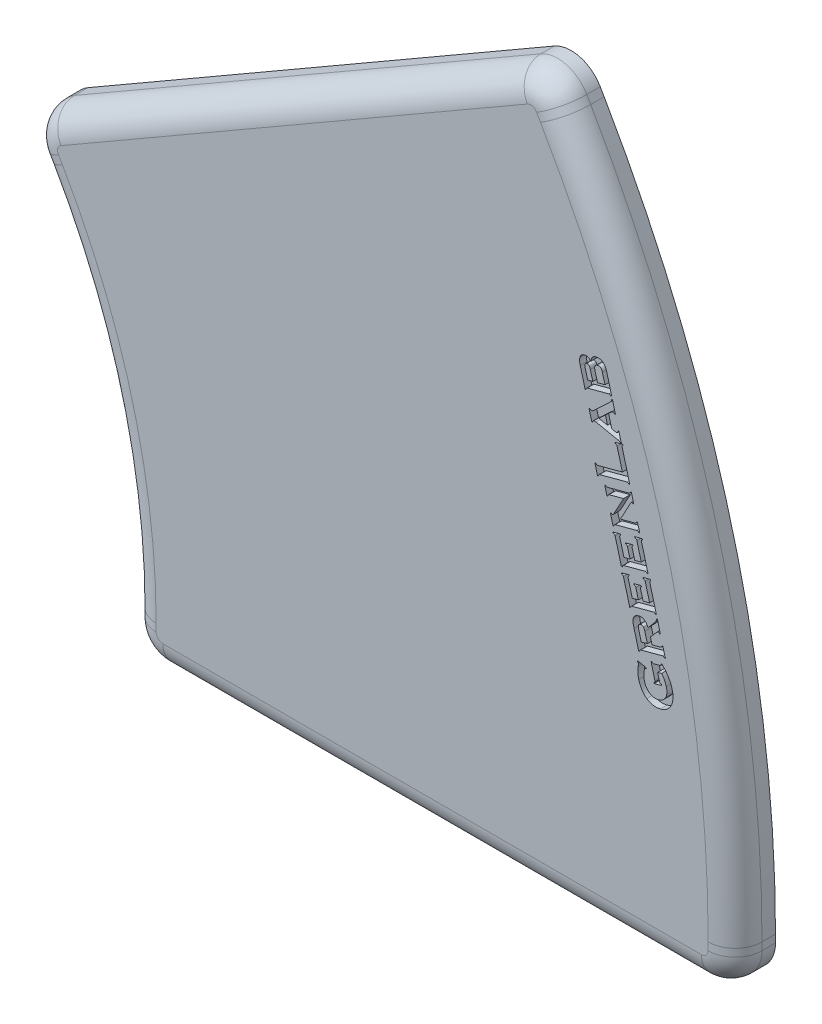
from build123d import *

# Parameters (mm, degrees)
BOSS_EXTRUDE1_DEPTH = 3
FILLET1_R           = 2.500000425
FILLET2_R           = 49.999999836
FILLET3_R           = 94.999999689
FILLET4_R           = 2
CUT_EXTRUDE1_DEPTH  = 0.5


with BuildPart() as part:
    # Sketch1 → Boss-Extrude1 (new body)
    with BuildSketch(Plane.XY.offset(3)):
        Polygon((22.499998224, 6.029140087), (8.235553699, 30.735565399), (-30.735566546, 8.235575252), (-22.500001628, -6.028922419), (-22.500001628, -22.500000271), (22.499998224, -22.500000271), align=None)
    extrude(amount=-BOSS_EXTRUDE1_DEPTH)

    # Fillet1
    fillet1_edges = [part.edges().sort_by_distance(p)[0] for p in [
        (22.499998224, -22.500000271, 1.5),
        (-22.500001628, -22.500000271, 1.5),
        (-30.735566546, 8.235575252, 1.5),
        (8.235553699, 30.735565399, 1.5),
    ]]
    fillet(fillet1_edges, radius=FILLET1_R)

    # Fillet2
    fillet2_edges = [part.edges().sort_by_distance(p)[0] for p in [
        (-22.500001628, -6.028922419, 1.5),
    ]]
    fillet(fillet2_edges, radius=FILLET2_R)

    # Fillet3
    fillet3_edges = [part.edges().sort_by_distance(p)[0] for p in [
        (22.499998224, 6.029140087, 1.5),
    ]]
    fillet(fillet3_edges, radius=FILLET3_R)

    # Fillet4
    fillet4_edges = [part.edges().sort_by_distance(p)[0] for p in [
        (22.499998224, -19.713158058, 3),
        (-11.250003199, 19.485572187, 3),
        (-29.342122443, 5.822045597, 3),
        (-1.702e-06, -22.500000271, 3),
        (7.967543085, 29.735324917, 3),
        (-29.735322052, 7.967559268, 3),
        (21.767765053, -21.767767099, 3),
        (-21.767768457, -21.767767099, 3),
        (-22.500001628, -19.713158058, 3),
        (-24.203694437, -6.485423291, 3),
        (9.628853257, 28.322330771, 3),
        (19.262883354, 5.161748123, 3),
    ]]
    fillet(fillet4_edges, radius=FILLET4_R)

    # Sketch2 → Cut-Extrude1 (cut)
    # profile 1 of 8: a face of its own
    with BuildSketch(Plane.XY.offset(3)):
        with BuildLine():
            add(Edge.make_bspline(
                [(11.784015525, 13.560716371), (11.788785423, 13.586693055), (11.79776732, 13.635608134), (11.817596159, 13.702996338), (11.836841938, 13.761903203), (11.854832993, 13.796002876), (11.863225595, 13.811909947)],
                knots=[0, 0, 0, 0, 1.197007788, 2.254010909, 3.185517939, 4, 4, 4, 4], degree=3))
            add(Edge.make_bspline(
                [(11.863225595, 13.811909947), (11.871223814, 13.825684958), (11.887187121, 13.853177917), (11.916786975, 13.890506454), (11.950199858, 13.924588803), (11.987646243, 13.954777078), (12.028862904, 13.981766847), (12.074079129, 14.004845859), (12.123091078, 14.025380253), (12.157880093, 14.035252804), (12.175725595, 14.040317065)],
                knots=[0, 0, 0, 0, 0.958541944, 1.913113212, 2.860695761, 3.828848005, 4.804875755, 5.823276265, 6.883419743, 8, 8, 8, 8], degree=3))
            add(Edge.make_bspline(
                [(12.175725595, 14.040317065), (12.199864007, 14.046045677), (12.24686738, 14.057200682), (12.317281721, 14.065472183), (12.385356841, 14.0654596), (12.450952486, 14.058048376), (12.514421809, 14.042644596), (12.575343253, 14.01921256), (12.633913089, 13.987649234), (12.669737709, 13.9610253), (12.687878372, 13.947543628)],
                knots=[0, 0, 0, 0, 1.099379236, 2.140759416, 3.135076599, 4.111810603, 5.060899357, 6.022907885, 6.998851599, 8, 8, 8, 8], degree=3))
            add(Edge.make_bspline(
                [(12.687878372, 13.947543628), (12.70374739, 13.934318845), (12.735950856, 13.907481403), (12.779056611, 13.860223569), (12.819545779, 13.80791183), (12.856284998, 13.749627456), (12.889944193, 13.685680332), (12.920867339, 13.616380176), (12.948083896, 13.541083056), (12.962913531, 13.488480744), (12.970538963, 13.461432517)],
                knots=[0, 0, 0, 0, 0.865921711, 1.757240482, 2.677047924, 3.639114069, 4.64392552, 5.707210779, 6.821042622, 8, 8, 8, 8], degree=3))
            Line((12.970538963, 13.461432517), (13.340005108, 12.082309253))
            Line((13.340005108, 12.082309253), (13.270560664, 12.063863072))
            add(Edge.make_bspline(
                [(13.270560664, 12.063863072), (13.265479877, 12.071925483), (13.255880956, 12.087157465), (13.239754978, 12.10719443), (13.222164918, 12.121801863), (13.204298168, 12.132997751), (13.184675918, 12.138896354), (13.163172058, 12.14101245), (13.139519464, 12.13930884), (13.12330692, 12.135364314), (13.114853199, 12.133307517)],
                knots=[0, 0, 0, 0, 1.219507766, 2.303965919, 3.272885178, 4.134119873, 4.983142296, 5.867388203, 6.887990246, 8, 8, 8, 8], degree=3))
            Line((13.114853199, 12.133307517), (11.53065181, 11.709045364))
            add(Edge.make_bspline(
                [(11.53065181, 11.709045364), (11.522268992, 11.706531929), (11.506601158, 11.701834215), (11.485201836, 11.692152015), (11.46833364, 11.679467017), (11.454408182, 11.664880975), (11.444494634, 11.646711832), (11.437791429, 11.624905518), (11.432081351, 11.599354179), (11.43090951, 11.580683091), (11.430282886, 11.57069901)],
                knots=[0, 0, 0, 0, 1.120259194, 2.093810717, 2.9875502, 3.806806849, 4.656892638, 5.608726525, 6.721302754, 8, 8, 8, 8], degree=3))
            Line((11.430282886, 11.57069901), (11.360838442, 11.552252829))
            Line((11.360838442, 11.552252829), (10.998967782, 12.904249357))
            add(Edge.make_bspline(
                [(10.998967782, 12.904249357), (10.991525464, 12.932918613), (10.977101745, 12.988481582), (10.962565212, 13.070348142), (10.951228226, 13.146995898), (10.947961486, 13.219053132), (10.948279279, 13.286221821), (10.955637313, 13.348662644), (10.967362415, 13.406394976), (10.980621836, 13.442033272), (10.987032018, 13.459262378)],
                knots=[0, 0, 0, 0, 1.258748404, 2.43954005, 3.533451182, 4.549791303, 5.50331941, 6.385516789, 7.219488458, 8, 8, 8, 8], degree=3))
            add(Edge.make_bspline(
                [(10.987032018, 13.459262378), (10.994798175, 13.476275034), (11.010094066, 13.509782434), (11.039251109, 13.556212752), (11.072700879, 13.598352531), (11.11188969, 13.634814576), (11.154999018, 13.667025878), (11.202547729, 13.694932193), (11.254833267, 13.717861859), (11.291977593, 13.728765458), (11.310925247, 13.734327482)],
                knots=[0, 0, 0, 0, 1.016246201, 2.001555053, 2.97396476, 3.934209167, 4.904078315, 5.896042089, 6.926752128, 8, 8, 8, 8], degree=3))
            add(Edge.make_bspline(
                [(11.310925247, 13.734327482), (11.333244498, 13.739449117), (11.37607983, 13.74927861), (11.439739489, 13.753899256), (11.499300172, 13.748537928), (11.555935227, 13.733559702), (11.61138194, 13.707161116), (11.66782118, 13.66960163), (11.726610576, 13.620326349), (11.76413553, 13.581359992), (11.784015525, 13.560716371)],
                knots=[0, 0, 0, 0, 1.024066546, 1.965398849, 2.843474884, 3.68985353, 4.573621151, 5.579575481, 6.717705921, 8, 8, 8, 8], degree=3))
        make_face()
        with BuildLine():
            Line((11.932127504, 12.337843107), (11.750378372, 13.016554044))
            add(Edge.make_bspline(
                [(11.750378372, 13.016554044), (11.743107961, 13.041057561), (11.729630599, 13.086480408), (11.706381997, 13.147958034), (11.678264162, 13.195307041), (11.648975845, 13.231817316), (11.613604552, 13.255525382), (11.573241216, 13.268481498), (11.527249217, 13.268700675), (11.496189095, 13.262059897), (11.479653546, 13.25852453)],
                knots=[0, 0, 0, 0, 1.469799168, 2.72460733, 3.764042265, 4.62665216, 5.390733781, 6.176502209, 7.029220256, 8, 8, 8, 8], degree=3))
            add(Edge.make_bspline(
                [(11.479653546, 13.25852453), (11.463829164, 13.253587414), (11.433931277, 13.244259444), (11.395443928, 13.220738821), (11.366791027, 13.190189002), (11.348106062, 13.152366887), (11.339839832, 13.106064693), (11.341684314, 13.050808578), (11.350476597, 12.985329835), (11.362130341, 12.939048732), (11.368433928, 12.914014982)],
                knots=[0, 0, 0, 0, 0.953038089, 1.800628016, 2.567855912, 3.337135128, 4.197894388, 5.250892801, 6.512989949, 8, 8, 8, 8], degree=3))
            Line((11.368433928, 12.914014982), (11.55018306, 12.235304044))
            Line((11.55018306, 12.235304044), (11.932127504, 12.337843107))
        make_face(mode=Mode.SUBTRACT)
        with BuildLine():
            Line((12.834905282, 12.579813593), (12.646645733, 13.281310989))
            add(Edge.make_bspline(
                [(12.646645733, 13.281310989), (12.638869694, 13.307791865), (12.624248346, 13.357584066), (12.59269059, 13.424177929), (12.555247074, 13.478245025), (12.511085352, 13.519105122), (12.460651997, 13.546958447), (12.404045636, 13.5602376), (12.341750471, 13.561511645), (12.299837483, 13.551757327), (12.277722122, 13.546610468)],
                knots=[0, 0, 0, 0, 1.273381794, 2.394349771, 3.388796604, 4.293543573, 5.149618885, 6.018840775, 6.954642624, 8, 8, 8, 8], degree=3))
            add(Edge.make_bspline(
                [(12.277722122, 13.546610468), (12.25623249, 13.539842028), (12.215442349, 13.52699464), (12.161720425, 13.495544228), (12.119991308, 13.455057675), (12.089245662, 13.406121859), (12.072462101, 13.348253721), (12.066955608, 13.282789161), (12.072816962, 13.209410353), (12.084751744, 13.158925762), (12.091090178, 13.13211394)],
                knots=[0, 0, 0, 0, 1.039272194, 1.972674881, 2.84767734, 3.703743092, 4.613444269, 5.604239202, 6.727637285, 8, 8, 8, 8], degree=3))
            Line((12.091090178, 13.13211394), (12.279349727, 12.430616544))
            Line((12.279349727, 12.430616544), (12.834905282, 12.579813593))
        make_face(mode=Mode.SUBTRACT)
    # profile 2 of 8: a face of its own
    with BuildSketch(Plane.XY.offset(3)):
        with BuildLine():
            Line((13.10960784, 10.859195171), (13.338557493, 10.004160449))
            Line((13.338557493, 10.004160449), (13.589208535, 9.943939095))
            add(Edge.make_bspline(
                [(13.589208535, 9.943939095), (13.603103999, 9.941507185), (13.628979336, 9.936978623), (13.665268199, 9.934476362), (13.6963251, 9.934116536), (13.714744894, 9.937871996), (13.723214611, 9.939598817)],
                knots=[0, 0, 0, 0, 1.252881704, 2.333044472, 3.233507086, 4, 4, 4, 4], degree=3))
            add(Edge.make_bspline(
                [(13.723214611, 9.939598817), (13.73006129, 9.941602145), (13.743348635, 9.945490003), (13.76034481, 9.957010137), (13.7749271, 9.970762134), (13.78649517, 9.987935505), (13.794542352, 10.008306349), (13.799283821, 10.0317913), (13.801365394, 10.058202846), (13.800636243, 10.076859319), (13.800254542, 10.086625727)],
                knots=[0, 0, 0, 0, 0.934657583, 1.813889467, 2.673522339, 3.565899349, 4.517420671, 5.541120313, 6.712810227, 8, 8, 8, 8], degree=3))
            Line((13.800254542, 10.086625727), (13.869698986, 10.105071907))
            Line((13.869698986, 10.105071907), (14.060671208, 9.393266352))
            Line((14.060671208, 9.393266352), (13.991226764, 9.374820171))
            add(Edge.make_bspline(
                [(13.991226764, 9.374820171), (13.98659383, 9.38489839), (13.977808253, 9.404010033), (13.961567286, 9.429033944), (13.944097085, 9.449107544), (13.924220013, 9.464853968), (13.900034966, 9.477863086), (13.869109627, 9.488650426), (13.831334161, 9.500126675), (13.80338015, 9.50648533), (13.788318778, 9.509911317)],
                knots=[0, 0, 0, 0, 1.034261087, 1.961301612, 2.774369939, 3.507259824, 4.315583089, 5.325167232, 6.558823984, 8, 8, 8, 8], degree=3))
            Line((13.788318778, 9.509911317), (12.162342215, 9.848995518))
            add(Edge.make_bspline(
                [(12.162342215, 9.848995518), (12.147729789, 9.851660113), (12.119906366, 9.856733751), (12.079583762, 9.859109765), (12.043006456, 9.859058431), (12.020514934, 9.854066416), (12.009889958, 9.851708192)],
                knots=[0, 0, 0, 0, 1.158496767, 2.205886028, 3.15246206, 4, 4, 4, 4], degree=3))
            add(Edge.make_bspline(
                [(12.009889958, 9.851708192), (11.99867573, 9.847483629), (11.976037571, 9.838955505), (11.950723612, 9.809201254), (11.93338093, 9.769711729), (11.928478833, 9.739249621), (11.925797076, 9.722584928)],
                knots=[0, 0, 0, 0, 0.865666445, 1.74752061, 2.767751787, 4, 4, 4, 4], degree=3))
            Line((11.925797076, 9.722584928), (11.856352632, 9.704138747))
            Line((11.856352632, 9.704138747), (11.651274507, 10.46965524))
            Line((11.651274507, 10.46965524), (11.720718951, 10.488101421))
            add(Edge.make_bspline(
                [(11.720718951, 10.488101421), (11.730917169, 10.47529606), (11.749890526, 10.451472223), (11.786314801, 10.427887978), (11.825335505, 10.416127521), (11.850899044, 10.420675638), (11.863948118, 10.422997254)],
                knots=[0, 0, 0, 0, 1.164096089, 2.165752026, 3.063696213, 4, 4, 4, 4], degree=3))
            add(Edge.make_bspline(
                [(11.863948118, 10.422997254), (11.87384621, 10.4263108), (11.895130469, 10.433436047), (11.92629801, 10.451600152), (11.959734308, 10.474942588), (11.981159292, 10.494172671), (11.992528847, 10.504377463)],
                knots=[0, 0, 0, 0, 0.814363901, 1.751158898, 2.806611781, 4, 4, 4, 4], degree=3))
            Line((11.992528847, 10.504377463), (13.182307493, 11.619286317))
            add(Edge.make_bspline(
                [(13.182307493, 11.619286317), (13.197102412, 11.633429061), (13.224107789, 11.659244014), (13.258864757, 11.69633215), (13.28546627, 11.726669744), (13.303376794, 11.753402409), (13.314927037, 11.779382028), (13.320169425, 11.808047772), (13.323148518, 11.840230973), (13.321870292, 11.862879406), (13.321196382, 11.874820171)],
                knots=[0, 0, 0, 0, 1.609807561, 2.938404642, 3.998631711, 4.779990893, 5.46188282, 6.218096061, 7.060539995, 8, 8, 8, 8], degree=3))
            Line((13.321196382, 11.874820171), (13.390640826, 11.893266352))
            Line((13.390640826, 11.893266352), (13.614165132, 11.059933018))
            Line((13.614165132, 11.059933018), (13.544720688, 11.041486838))
            add(Edge.make_bspline(
                [(13.544720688, 11.041486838), (13.540812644, 11.049590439), (13.533409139, 11.064942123), (13.518965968, 11.084621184), (13.503721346, 11.100848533), (13.486841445, 11.113031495), (13.46843673, 11.120780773), (13.448890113, 11.124642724), (13.428049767, 11.124644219), (13.414115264, 11.121683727), (13.406916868, 11.120154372)],
                knots=[0, 0, 0, 0, 1.231489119, 2.332966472, 3.332848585, 4.275727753, 5.164874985, 6.050208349, 6.992761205, 8, 8, 8, 8], degree=3))
            add(Edge.make_bspline(
                [(13.406916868, 11.120154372), (13.397175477, 11.117073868), (13.376274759, 11.110464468), (13.346212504, 11.091982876), (13.313628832, 11.068565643), (13.292769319, 11.049168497), (13.281591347, 11.038774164)],
                knots=[0, 0, 0, 0, 0.809823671, 1.737523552, 2.787608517, 4, 4, 4, 4], degree=3))
            Line((13.281591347, 11.038774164), (13.10960784, 10.859195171))
        make_face()
        Polygon((12.870892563, 10.640553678), (12.381526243, 10.19621774), (13.023887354, 10.067637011), align=None, mode=Mode.SUBTRACT)
    # profile 3 of 8: a face of its own
    with BuildSketch(Plane.XY.offset(3)):
        with BuildLine():
            Line((14.128974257, 7.609811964), (13.735636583, 9.078995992))
            add(Edge.make_bspline(
                [(13.735636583, 9.078995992), (13.733162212, 9.087400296), (13.728469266, 9.103340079), (13.718084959, 9.124807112), (13.705714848, 9.142347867), (13.690920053, 9.156360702), (13.672649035, 9.166051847), (13.651205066, 9.173948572), (13.625435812, 9.17771603), (13.607061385, 9.178792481), (13.597290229, 9.179364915)],
                knots=[0, 0, 0, 0, 1.116980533, 2.118489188, 3.028257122, 3.845116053, 4.692713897, 5.649313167, 6.749951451, 8, 8, 8, 8], degree=3))
            Line((13.597290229, 9.179364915), (13.578301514, 9.24880936))
            Line((13.578301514, 9.24880936), (14.168579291, 9.406686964))
            Line((14.168579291, 9.406686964), (14.187568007, 9.33724252))
            add(Edge.make_bspline(
                [(14.187568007, 9.33724252), (14.17931569, 9.331987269), (14.163698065, 9.322041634), (14.143529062, 9.305539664), (14.128542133, 9.288336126), (14.117414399, 9.270995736), (14.111211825, 9.251773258), (14.110106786, 9.230533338), (14.111600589, 9.206947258), (14.115503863, 9.190715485), (14.117581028, 9.182077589)],
                knots=[0, 0, 0, 0, 1.251164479, 2.367846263, 3.318877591, 4.160015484, 4.986713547, 5.868542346, 6.865724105, 8, 8, 8, 8], degree=3))
            Line((14.117581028, 9.182077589), (14.67856193, 7.087351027))
            Line((14.67856193, 7.087351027), (14.609117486, 7.068904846))
            add(Edge.make_bspline(
                [(14.609117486, 7.068904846), (14.603660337, 7.077151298), (14.593523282, 7.092469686), (14.577036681, 7.112507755), (14.560561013, 7.128061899), (14.542821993, 7.138300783), (14.524037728, 7.144680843), (14.50297319, 7.146545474), (14.479534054, 7.144861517), (14.463493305, 7.140952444), (14.455037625, 7.138891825)],
                knots=[0, 0, 0, 0, 1.273472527, 2.365568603, 3.339083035, 4.174486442, 4.985143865, 5.875617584, 6.880158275, 8, 8, 8, 8], degree=3))
            Line((14.455037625, 7.138891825), (12.450914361, 6.602324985))
            add(Edge.make_bspline(
                [(12.450914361, 6.602324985), (12.442501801, 6.599871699), (12.426702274, 6.595264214), (12.405603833, 6.584788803), (12.388563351, 6.572248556), (12.37484011, 6.557687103), (12.364664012, 6.53989179), (12.357820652, 6.518287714), (12.353715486, 6.49251593), (12.3527115, 6.473940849), (12.352173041, 6.463978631)],
                knots=[0, 0, 0, 0, 1.123146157, 2.109366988, 3.005409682, 3.826777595, 4.65889984, 5.61318665, 6.719900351, 8, 8, 8, 8], degree=3))
            Line((12.352173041, 6.463978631), (12.282728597, 6.44553245))
            Line((12.282728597, 6.44553245), (12.087416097, 7.174699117))
            Line((12.087416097, 7.174699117), (12.156860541, 7.193145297))
            add(Edge.make_bspline(
                [(12.156860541, 7.193145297), (12.161890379, 7.184859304), (12.17145539, 7.169102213), (12.188064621, 7.149339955), (12.204796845, 7.133842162), (12.222521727, 7.122814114), (12.242473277, 7.11768835), (12.26388005, 7.115409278), (12.287709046, 7.117257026), (12.30393383, 7.121108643), (12.312568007, 7.123158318)],
                knots=[0, 0, 0, 0, 1.233803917, 2.346268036, 3.276451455, 4.134146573, 4.97305777, 5.876592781, 6.870008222, 8, 8, 8, 8], degree=3))
            Line((12.312568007, 7.123158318), (14.128974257, 7.609811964))
        make_face()
    # profile 4 of 8: a face of its own
    with BuildSketch(Plane.XY.offset(3)):
        with BuildLine():
            Line((13.979318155, 4.507847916), (15.077408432, 4.80244427))
            add(Edge.make_bspline(
                [(15.077408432, 4.80244427), (15.085804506, 4.804930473), (15.10172868, 4.80964586), (15.123167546, 4.819816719), (15.140476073, 4.832709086), (15.154735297, 4.847689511), (15.165052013, 4.866240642), (15.172588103, 4.888096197), (15.178131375, 4.913402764), (15.178966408, 4.931715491), (15.17940496, 4.941333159)],
                knots=[0, 0, 0, 0, 1.112651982, 2.110279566, 2.997950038, 3.844140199, 4.719814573, 5.672706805, 6.777727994, 8, 8, 8, 8], degree=3))
            Line((15.17940496, 4.941333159), (15.248849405, 4.959779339))
            Line((15.248849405, 4.959779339), (15.415950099, 4.334779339))
            Line((15.415950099, 4.334779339), (15.346505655, 4.316333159))
            add(Edge.make_bspline(
                [(15.346505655, 4.316333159), (15.341424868, 4.32439557), (15.331825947, 4.339627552), (15.315699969, 4.359664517), (15.298109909, 4.374271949), (15.280243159, 4.385467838), (15.260620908, 4.39136644), (15.239117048, 4.393482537), (15.215464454, 4.391778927), (15.199251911, 4.387834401), (15.190798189, 4.385777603)],
                knots=[0, 0, 0, 0, 1.219507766, 2.303965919, 3.272885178, 4.134119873, 4.983142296, 5.867388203, 6.887990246, 8, 8, 8, 8], degree=3))
            Line((15.190798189, 4.385777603), (13.6065968, 3.961515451))
            add(Edge.make_bspline(
                [(13.6065968, 3.961515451), (13.598213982, 3.959002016), (13.582546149, 3.954304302), (13.561146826, 3.944622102), (13.544278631, 3.931937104), (13.530353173, 3.917351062), (13.520439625, 3.899181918), (13.513736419, 3.877375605), (13.508026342, 3.851824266), (13.506854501, 3.833153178), (13.506227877, 3.823169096)],
                knots=[0, 0, 0, 0, 1.120259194, 2.093810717, 2.9875502, 3.806806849, 4.656892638, 5.608726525, 6.721302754, 8, 8, 8, 8], degree=3))
            Line((13.506227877, 3.823169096), (13.436783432, 3.804722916))
            Line((13.436783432, 3.804722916), (13.238215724, 4.545825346))
            Line((13.238215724, 4.545825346), (13.307660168, 4.564271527))
            add(Edge.make_bspline(
                [(13.307660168, 4.564271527), (13.314127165, 4.553852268), (13.325731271, 4.53515639), (13.347038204, 4.513356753), (13.371616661, 4.502394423), (13.38771018, 4.504602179), (13.395550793, 4.505677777)],
                knots=[0, 0, 0, 0, 1.290345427, 2.315341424, 3.179249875, 4, 4, 4, 4], degree=3))
            add(Edge.make_bspline(
                [(13.395550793, 4.505677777), (13.402608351, 4.508416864), (13.418112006, 4.514433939), (13.438989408, 4.532138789), (13.459257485, 4.556897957), (13.471385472, 4.576397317), (13.478016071, 4.587057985)],
                knots=[0, 0, 0, 0, 0.762868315, 1.675827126, 2.729330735, 4, 4, 4, 4], degree=3))
            Line((13.478016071, 4.587057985), (14.218033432, 5.948820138))
            Line((14.218033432, 5.948820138), (13.150867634, 5.662904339))
            add(Edge.make_bspline(
                [(13.150867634, 5.662904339), (13.142503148, 5.660355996), (13.126712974, 5.655545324), (13.104943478, 5.646202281), (13.088034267, 5.633124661), (13.073491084, 5.618949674), (13.063684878, 5.600534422), (13.056792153, 5.578838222), (13.051844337, 5.553156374), (13.050967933, 5.534530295), (13.05049871, 5.524557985)],
                knots=[0, 0, 0, 0, 1.116021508, 2.106785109, 2.997143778, 3.829119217, 4.675989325, 5.62422264, 6.72802063, 8, 8, 8, 8], degree=3))
            Line((13.05049871, 5.524557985), (12.981054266, 5.506111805))
            Line((12.981054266, 5.506111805), (12.813411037, 6.131111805))
            Line((12.813411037, 6.131111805), (12.882855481, 6.149557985))
            add(Edge.make_bspline(
                [(12.882855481, 6.149557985), (12.888267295, 6.141271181), (12.898384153, 6.125779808), (12.915509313, 6.106151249), (12.932001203, 6.090181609), (12.950281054, 6.080231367), (12.969541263, 6.073571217), (12.991005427, 6.072857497), (13.014625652, 6.073322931), (13.030652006, 6.077413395), (13.039105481, 6.079571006)],
                knots=[0, 0, 0, 0, 1.261303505, 2.357883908, 3.322095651, 4.169556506, 4.994397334, 5.897257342, 6.890859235, 8, 8, 8, 8], degree=3))
            Line((13.039105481, 6.079571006), (14.621679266, 6.503833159))
            add(Edge.make_bspline(
                [(14.621679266, 6.503833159), (14.630086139, 6.506304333), (14.646030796, 6.510991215), (14.667237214, 6.52130531), (14.684704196, 6.533350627), (14.6984658, 6.548026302), (14.708387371, 6.566396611), (14.715701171, 6.588250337), (14.721295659, 6.614079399), (14.722492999, 6.632742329), (14.723133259, 6.642722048)],
                knots=[0, 0, 0, 0, 1.113758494, 2.1123782, 2.987410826, 3.801913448, 4.647066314, 5.622602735, 6.728722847, 8, 8, 8, 8], degree=3))
            Line((14.723133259, 6.642722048), (14.792577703, 6.661168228))
            Line((14.792577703, 6.661168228), (14.978124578, 5.969978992))
            Line((14.978124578, 5.969978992), (14.908680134, 5.951532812))
            add(Edge.make_bspline(
                [(14.908680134, 5.951532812), (14.903035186, 5.962010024), (14.89282025, 5.980969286), (14.872097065, 6.002181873), (14.848241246, 6.01352578), (14.83244659, 6.011255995), (14.824587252, 6.010126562)],
                knots=[0, 0, 0, 0, 1.277934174, 2.312512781, 3.160315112, 4, 4, 4, 4], degree=3))
            add(Edge.make_bspline(
                [(14.824587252, 6.010126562), (14.816628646, 6.006854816), (14.799079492, 5.99964044), (14.782067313, 5.978970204), (14.766195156, 5.956192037), (14.750425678, 5.929053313), (14.728326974, 5.894936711), (14.713066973, 5.868781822), (14.704687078, 5.854419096)],
                knots=[0, 0, 0, 0, 0.764326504, 1.685380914, 2.340113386, 3.275298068, 4.503754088, 6, 6, 6, 6], degree=3))
            Line((14.704687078, 5.854419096), (13.979318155, 4.507847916))
        make_face()
    # profile 5 of 8: a face of its own
    with BuildSketch(Plane.XY.offset(3)):
        with BuildLine():
            Line((15.044826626, 2.387335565), (15.530937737, 2.518086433))
            Line((15.530937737, 2.518086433), (15.202161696, 3.74475744))
            add(Edge.make_bspline(
                [(15.202161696, 3.74475744), (15.199597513, 3.752938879), (15.194711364, 3.768528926), (15.185430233, 3.790101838), (15.172576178, 3.807077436), (15.158088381, 3.820864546), (15.14002774, 3.831011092), (15.118396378, 3.838482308), (15.092338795, 3.84246011), (15.073772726, 3.843489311), (15.063815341, 3.844041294)],
                knots=[0, 0, 0, 0, 1.098587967, 2.093401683, 2.987400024, 3.806893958, 4.637117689, 5.618632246, 6.722820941, 8, 8, 8, 8], degree=3))
            Line((15.063815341, 3.844041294), (15.045369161, 3.913485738))
            Line((15.045369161, 3.913485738), (15.600924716, 4.062140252))
            Line((15.600924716, 4.062140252), (15.619370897, 3.992695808))
            add(Edge.make_bspline(
                [(15.619370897, 3.992695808), (15.611308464, 3.987615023), (15.596076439, 3.978016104), (15.576039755, 3.961890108), (15.561431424, 3.944300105), (15.550238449, 3.926433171), (15.544276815, 3.906637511), (15.542242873, 3.884942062), (15.543915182, 3.861112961), (15.547866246, 3.844899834), (15.549926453, 3.836445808)],
                knots=[0, 0, 0, 0, 1.216009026, 2.297355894, 3.263495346, 4.122259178, 4.968845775, 5.873506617, 6.891180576, 8, 8, 8, 8], degree=3))
            Line((15.549926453, 3.836445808), (16.036037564, 2.020582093))
            Line((16.036037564, 2.020582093), (15.966593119, 2.002135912))
            add(Edge.make_bspline(
                [(15.966593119, 2.002135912), (15.961512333, 2.010198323), (15.951913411, 2.025430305), (15.935787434, 2.04546727), (15.918197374, 2.060074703), (15.900330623, 2.071270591), (15.880708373, 2.077169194), (15.859204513, 2.07928529), (15.835551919, 2.07758168), (15.819339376, 2.073637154), (15.810885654, 2.071580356)],
                knots=[0, 0, 0, 0, 1.219507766, 2.303965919, 3.272885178, 4.134119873, 4.983142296, 5.867388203, 6.887990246, 8, 8, 8, 8], degree=3))
            Line((15.810885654, 2.071580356), (14.226684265, 1.647318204))
            add(Edge.make_bspline(
                [(14.226684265, 1.647318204), (14.218301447, 1.644804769), (14.202633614, 1.640107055), (14.181234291, 1.630424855), (14.164366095, 1.617739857), (14.150440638, 1.603153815), (14.14052709, 1.584984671), (14.133823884, 1.563178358), (14.128113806, 1.537627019), (14.126941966, 1.518955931), (14.126315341, 1.50897185)],
                knots=[0, 0, 0, 0, 1.120259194, 2.093810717, 2.9875502, 3.806806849, 4.656892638, 5.608726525, 6.721302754, 8, 8, 8, 8], degree=3))
            Line((14.126315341, 1.50897185), (14.056870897, 1.490525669))
            Line((14.056870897, 1.490525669), (13.589205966, 3.236402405))
            add(Edge.make_bspline(
                [(13.589205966, 3.236402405), (13.586753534, 3.244994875), (13.582144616, 3.26114292), (13.57164735, 3.282753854), (13.559285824, 3.300297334), (13.544489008, 3.314309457), (13.526218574, 3.324001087), (13.504774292, 3.331896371), (13.478826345, 3.335696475), (13.46026951, 3.336749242), (13.450317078, 3.337313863)],
                knots=[0, 0, 0, 0, 1.132581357, 2.128488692, 3.0331684, 3.845458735, 4.688316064, 5.639565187, 6.734047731, 8, 8, 8, 8], degree=3))
            Line((13.450317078, 3.337313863), (13.431870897, 3.406758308))
            Line((13.431870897, 3.406758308), (13.987426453, 3.555955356))
            Line((13.987426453, 3.555955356), (14.005872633, 3.486510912))
            add(Edge.make_bspline(
                [(14.005872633, 3.486510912), (13.997693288, 3.480987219), (13.982383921, 3.470648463), (13.961419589, 3.454855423), (13.947104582, 3.437056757), (13.935487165, 3.419854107), (13.930427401, 3.40034698), (13.928124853, 3.379317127), (13.929992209, 3.355660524), (13.933838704, 3.339436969), (13.935885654, 3.330803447)],
                knots=[0, 0, 0, 0, 1.262388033, 2.362825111, 3.330075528, 4.170045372, 4.988779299, 5.871502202, 6.867299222, 8, 8, 8, 8], degree=3))
            Line((13.935885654, 3.330803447), (14.246215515, 2.173576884))
            Line((14.246215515, 2.173576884), (14.697604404, 2.294562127))
            Line((14.697604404, 2.294562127), (14.507717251, 3.002027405))
            add(Edge.make_bspline(
                [(14.507717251, 3.002027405), (14.505516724, 3.010295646), (14.501374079, 3.025861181), (14.490424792, 3.046118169), (14.478960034, 3.063469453), (14.463846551, 3.076574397), (14.445963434, 3.086564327), (14.424171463, 3.093392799), (14.398494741, 3.098223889), (14.379884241, 3.099527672), (14.369913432, 3.10022619)],
                knots=[0, 0, 0, 0, 1.101262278, 2.073202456, 2.961483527, 3.772650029, 4.630598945, 5.591237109, 6.709475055, 8, 8, 8, 8], degree=3))
            Line((14.369913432, 3.10022619), (14.351467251, 3.169670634))
            Line((14.351467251, 3.169670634), (14.907022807, 3.318325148))
            Line((14.907022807, 3.318325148), (14.925468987, 3.248880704))
            add(Edge.make_bspline(
                [(14.925468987, 3.248880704), (14.917406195, 3.243606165), (14.902248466, 3.233690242), (14.882353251, 3.217370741), (14.866978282, 3.200689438), (14.855841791, 3.183163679), (14.849783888, 3.163923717), (14.847961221, 3.142771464), (14.848771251, 3.119270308), (14.852809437, 3.103250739), (14.854939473, 3.094800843)],
                knots=[0, 0, 0, 0, 1.241022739, 2.33307342, 3.306547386, 4.153857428, 4.986621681, 5.877058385, 6.880204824, 8, 8, 8, 8], degree=3))
            Line((14.854939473, 3.094800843), (15.044826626, 2.387335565))
        make_face()
    # profile 6 of 8: a face of its own
    with BuildSketch(Plane.XY.offset(3)):
        with BuildLine():
            Line((15.664914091, 0.073138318), (16.151025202, 0.203889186))
            Line((16.151025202, 0.203889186), (15.82224916, 1.430560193))
            add(Edge.make_bspline(
                [(15.82224916, 1.430560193), (15.819684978, 1.438741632), (15.814798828, 1.45433168), (15.805517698, 1.475904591), (15.792663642, 1.492880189), (15.778175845, 1.506667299), (15.760115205, 1.516813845), (15.738483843, 1.524285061), (15.71242626, 1.528262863), (15.693860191, 1.529292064), (15.683902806, 1.529844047)],
                knots=[0, 0, 0, 0, 1.098587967, 2.093401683, 2.987400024, 3.806893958, 4.637117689, 5.618632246, 6.722820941, 8, 8, 8, 8], degree=3))
            Line((15.683902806, 1.529844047), (15.665456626, 1.599288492))
            Line((15.665456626, 1.599288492), (16.221012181, 1.747943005))
            Line((16.221012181, 1.747943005), (16.239458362, 1.678498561))
            add(Edge.make_bspline(
                [(16.239458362, 1.678498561), (16.231395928, 1.673417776), (16.216163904, 1.663818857), (16.196127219, 1.647692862), (16.181518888, 1.630102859), (16.170325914, 1.612235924), (16.16436428, 1.592440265), (16.162330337, 1.570744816), (16.164002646, 1.546915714), (16.16795371, 1.530702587), (16.170013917, 1.522248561)],
                knots=[0, 0, 0, 0, 1.216009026, 2.297355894, 3.263495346, 4.122259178, 4.968845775, 5.873506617, 6.891180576, 8, 8, 8, 8], degree=3))
            Line((16.170013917, 1.522248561), (16.656125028, -0.293615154))
            Line((16.656125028, -0.293615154), (16.586680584, -0.312061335))
            add(Edge.make_bspline(
                [(16.586680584, -0.312061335), (16.581599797, -0.303998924), (16.572000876, -0.288766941), (16.555874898, -0.268729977), (16.538284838, -0.254122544), (16.520418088, -0.242926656), (16.500795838, -0.237028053), (16.479291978, -0.234911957), (16.455639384, -0.236615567), (16.43942684, -0.240560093), (16.430973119, -0.24261689)],
                knots=[0, 0, 0, 0, 1.219507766, 2.303965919, 3.272885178, 4.134119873, 4.983142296, 5.867388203, 6.887990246, 8, 8, 8, 8], degree=3))
            Line((16.430973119, -0.24261689), (14.84677173, -0.666879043))
            add(Edge.make_bspline(
                [(14.84677173, -0.666879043), (14.838388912, -0.669392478), (14.822721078, -0.674090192), (14.801321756, -0.683772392), (14.78445356, -0.69645739), (14.770528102, -0.711043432), (14.760614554, -0.729212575), (14.753911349, -0.751018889), (14.748201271, -0.776570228), (14.74702943, -0.795241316), (14.746402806, -0.805225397)],
                knots=[0, 0, 0, 0, 1.120259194, 2.093810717, 2.9875502, 3.806806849, 4.656892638, 5.608726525, 6.721302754, 8, 8, 8, 8], degree=3))
            Line((14.746402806, -0.805225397), (14.676958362, -0.823671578))
            Line((14.676958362, -0.823671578), (14.209293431, 0.922205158))
            add(Edge.make_bspline(
                [(14.209293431, 0.922205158), (14.206840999, 0.930797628), (14.202232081, 0.946945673), (14.191734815, 0.968556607), (14.179373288, 0.986100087), (14.164576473, 1.00011221), (14.146306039, 1.00980384), (14.124861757, 1.017699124), (14.098913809, 1.021499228), (14.080356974, 1.022551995), (14.070404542, 1.023116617)],
                knots=[0, 0, 0, 0, 1.132581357, 2.128488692, 3.0331684, 3.845458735, 4.688316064, 5.639565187, 6.734047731, 8, 8, 8, 8], degree=3))
            Line((14.070404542, 1.023116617), (14.051958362, 1.092561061))
            Line((14.051958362, 1.092561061), (14.607513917, 1.24175811))
            Line((14.607513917, 1.24175811), (14.625960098, 1.172313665))
            add(Edge.make_bspline(
                [(14.625960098, 1.172313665), (14.617780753, 1.166789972), (14.602471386, 1.156451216), (14.581507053, 1.140658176), (14.567192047, 1.12285951), (14.555574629, 1.10565686), (14.550514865, 1.086149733), (14.548212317, 1.065119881), (14.550079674, 1.041463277), (14.553926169, 1.025239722), (14.555973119, 1.0166062)],
                knots=[0, 0, 0, 0, 1.262388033, 2.362825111, 3.330075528, 4.170045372, 4.988779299, 5.871502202, 6.867299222, 8, 8, 8, 8], degree=3))
            Line((14.555973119, 1.0166062), (14.86630298, -0.140620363))
            Line((14.86630298, -0.140620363), (15.317691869, -0.01963512))
            Line((15.317691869, -0.01963512), (15.127804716, 0.687830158))
            add(Edge.make_bspline(
                [(15.127804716, 0.687830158), (15.125604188, 0.696098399), (15.121461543, 0.711663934), (15.110512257, 0.731920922), (15.099047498, 0.749272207), (15.083934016, 0.76237715), (15.066050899, 0.77236708), (15.044258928, 0.779195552), (15.018582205, 0.784026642), (14.999971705, 0.785330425), (14.990000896, 0.786028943)],
                knots=[0, 0, 0, 0, 1.101262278, 2.073202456, 2.961483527, 3.772650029, 4.630598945, 5.591237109, 6.709475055, 8, 8, 8, 8], degree=3))
            Line((14.990000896, 0.786028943), (14.971554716, 0.855473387))
            Line((14.971554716, 0.855473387), (15.527110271, 1.004127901))
            Line((15.527110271, 1.004127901), (15.545556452, 0.934683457))
            add(Edge.make_bspline(
                [(15.545556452, 0.934683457), (15.53749366, 0.929408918), (15.522335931, 0.919492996), (15.502440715, 0.903173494), (15.487065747, 0.886492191), (15.475929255, 0.868966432), (15.469871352, 0.84972647), (15.468048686, 0.828574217), (15.468858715, 0.805073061), (15.472896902, 0.789053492), (15.475026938, 0.780603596)],
                knots=[0, 0, 0, 0, 1.241022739, 2.33307342, 3.306547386, 4.153857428, 4.986621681, 5.877058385, 6.880204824, 8, 8, 8, 8], degree=3))
            Line((15.475026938, 0.780603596), (15.664914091, 0.073138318))
        make_face()
    # profile 7 of 8: a face of its own
    with BuildSketch(Plane.XY.offset(3)):
        with BuildLine():
            Line((16.32993543, -2.408754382), (16.961445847, -2.239483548))
            add(Edge.make_bspline(
                [(16.961445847, -2.239483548), (16.970036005, -2.237028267), (16.986179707, -2.232413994), (17.007819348, -2.221952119), (17.025370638, -2.209402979), (17.039827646, -2.194813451), (17.05041592, -2.176525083), (17.057705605, -2.154343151), (17.06305908, -2.128294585), (17.064727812, -2.109482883), (17.065612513, -2.09950959)],
                knots=[0, 0, 0, 0, 1.120795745, 2.106339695, 3.001605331, 3.821022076, 4.666478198, 5.629241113, 6.74310832, 8, 8, 8, 8], degree=3))
            Line((17.065612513, -2.09950959), (17.135056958, -2.081063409))
            Line((17.135056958, -2.081063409), (17.321146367, -2.775507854))
            Line((17.321146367, -2.775507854), (17.251701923, -2.793954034))
            add(Edge.make_bspline(
                [(17.251701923, -2.793954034), (17.246621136, -2.785891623), (17.237022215, -2.770659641), (17.220896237, -2.750622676), (17.203306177, -2.736015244), (17.185439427, -2.724819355), (17.165817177, -2.718920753), (17.144313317, -2.716804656), (17.120660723, -2.718508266), (17.104448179, -2.722452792), (17.095994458, -2.72450959)],
                knots=[0, 0, 0, 0, 1.219507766, 2.303965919, 3.272885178, 4.134119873, 4.983142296, 5.867388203, 6.887990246, 8, 8, 8, 8], degree=3))
            Line((17.095994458, -2.72450959), (15.511793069, -3.148771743))
            add(Edge.make_bspline(
                [(15.511793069, -3.148771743), (15.503410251, -3.151285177), (15.487742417, -3.155982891), (15.466343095, -3.165665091), (15.449474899, -3.178350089), (15.435549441, -3.192936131), (15.425635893, -3.211105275), (15.418932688, -3.232911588), (15.41322261, -3.258462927), (15.412050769, -3.277134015), (15.411424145, -3.287118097)],
                knots=[0, 0, 0, 0, 1.120259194, 2.093810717, 2.9875502, 3.806806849, 4.656892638, 5.608726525, 6.721302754, 8, 8, 8, 8], degree=3))
            Line((15.411424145, -3.287118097), (15.341979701, -3.305564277))
            Line((15.341979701, -3.305564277), (14.996927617, -2.017586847))
            add(Edge.make_bspline(
                [(14.996927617, -2.017586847), (14.99163035, -1.997345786), (14.981335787, -1.958009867), (14.967213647, -1.900497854), (14.954830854, -1.84639939), (14.943756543, -1.796017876), (14.935114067, -1.749118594), (14.928109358, -1.705882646), (14.922365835, -1.666132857), (14.918233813, -1.618009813), (14.916074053, -1.561095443), (14.920027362, -1.494835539), (14.929294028, -1.430742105), (14.94078982, -1.389595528), (14.946471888, -1.369257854)],
                knots=[0, 0, 0, 0, 1.142332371, 2.219977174, 3.23313443, 4.172389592, 5.036105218, 5.836368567, 6.563885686, 7.228076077, 8.472798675, 9.669523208, 10.848106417, 12, 12, 12, 12], degree=3))
            add(Edge.make_bspline(
                [(14.946471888, -1.369257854), (14.953726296, -1.349144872), (14.967990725, -1.309596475), (14.998231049, -1.25453408), (15.036440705, -1.205149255), (15.081367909, -1.160607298), (15.133858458, -1.121834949), (15.192917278, -1.087940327), (15.259533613, -1.059783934), (15.30710168, -1.045625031), (15.331671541, -1.038311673)],
                knots=[0, 0, 0, 0, 0.964377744, 1.896267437, 2.822271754, 3.774963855, 4.743377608, 5.760219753, 6.843108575, 8, 8, 8, 8], degree=3))
            add(Edge.make_bspline(
                [(15.331671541, -1.038311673), (15.350778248, -1.033668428), (15.387835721, -1.02466285), (15.44319374, -1.0164741), (15.496378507, -1.013099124), (15.547625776, -1.014628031), (15.596715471, -1.021130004), (15.643941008, -1.032465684), (15.68874708, -1.049422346), (15.731943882, -1.070887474), (15.773295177, -1.097790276), (15.813775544, -1.129983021), (15.852660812, -1.168437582), (15.891428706, -1.211849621), (15.928623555, -1.261428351), (15.96496384, -1.316355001), (16.00037556, -1.376899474), (16.022348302, -1.419781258), (16.033711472, -1.441957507)],
                knots=[0, 0, 0, 0, 1.052361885, 2.041056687, 2.991753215, 3.902404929, 4.781573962, 5.638766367, 6.496669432, 7.341078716, 8.216667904, 9.133067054, 10.105410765, 11.141114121, 12.246911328, 13.420495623, 14.666013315, 16, 16, 16, 16], degree=3))
            Line((16.033711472, -1.441957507), (16.472079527, -0.935230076))
            add(Edge.make_bspline(
                [(16.472079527, -0.935230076), (16.490355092, -0.913682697), (16.523981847, -0.874035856), (16.56771647, -0.817154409), (16.601894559, -0.768936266), (16.625833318, -0.726467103), (16.642760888, -0.687863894), (16.652975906, -0.649659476), (16.658246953, -0.610748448), (16.65711103, -0.584763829), (16.656541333, -0.571731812)],
                knots=[0, 0, 0, 0, 1.617246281, 2.975707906, 4.107212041, 4.997179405, 5.762558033, 6.513515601, 7.254486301, 8, 8, 8, 8], degree=3))
            Line((16.656541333, -0.571731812), (16.725985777, -0.553285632))
            Line((16.725985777, -0.553285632), (16.950595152, -1.392586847))
            Line((16.950595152, -1.392586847), (16.881150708, -1.411033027))
            add(Edge.make_bspline(
                [(16.881150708, -1.411033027), (16.873347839, -1.398497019), (16.859363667, -1.37603019), (16.833417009, -1.350809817), (16.805315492, -1.336102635), (16.786504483, -1.338714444), (16.777526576, -1.339960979)],
                knots=[0, 0, 0, 0, 1.308683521, 2.345401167, 3.210311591, 4, 4, 4, 4], degree=3))
            add(Edge.make_bspline(
                [(16.777526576, -1.339960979), (16.770304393, -1.342920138), (16.753834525, -1.349668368), (16.730019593, -1.369242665), (16.702509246, -1.395561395), (16.684355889, -1.417150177), (16.674444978, -1.428936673)],
                knots=[0, 0, 0, 0, 0.67718046, 1.544279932, 2.659288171, 4, 4, 4, 4], degree=3))
            Line((16.674444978, -1.428936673), (16.208407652, -1.954652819))
            Line((16.208407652, -1.954652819), (16.32993543, -2.408754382))
        make_face()
        with BuildLine():
            Line((15.982713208, -2.501527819), (15.794996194, -1.802200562))
            add(Edge.make_bspline(
                [(15.794996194, -1.802200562), (15.787897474, -1.777505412), (15.774709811, -1.731627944), (15.751723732, -1.669005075), (15.726240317, -1.61793227), (15.705643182, -1.58984913), (15.696254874, -1.577048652)],
                knots=[0, 0, 0, 0, 1.245466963, 2.3137689, 3.231404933, 4, 4, 4, 4], degree=3))
            add(Edge.make_bspline(
                [(15.696254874, -1.577048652), (15.689807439, -1.569565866), (15.677205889, -1.554940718), (15.654368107, -1.53747898), (15.629954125, -1.523754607), (15.603193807, -1.514205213), (15.574364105, -1.509703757), (15.543738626, -1.508496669), (15.511080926, -1.511934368), (15.48913316, -1.517277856), (15.477613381, -1.520082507)],
                knots=[0, 0, 0, 0, 0.982860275, 1.92100603, 2.849565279, 3.76808385, 4.737779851, 5.748547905, 6.818274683, 8, 8, 8, 8], degree=3))
            add(Edge.make_bspline(
                [(15.477613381, -1.520082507), (15.458320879, -1.526200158), (15.422287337, -1.537626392), (15.375619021, -1.565072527), (15.340943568, -1.600000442), (15.322839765, -1.635671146), (15.315439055, -1.667237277), (15.31147756, -1.694277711), (15.310622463, -1.724639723), (15.312480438, -1.758146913), (15.316281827, -1.794932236), (15.322812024, -1.834780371), (15.332331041, -1.877936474), (15.339736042, -1.907651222), (15.343607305, -1.923185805)],
                knots=[0, 0, 0, 0, 1.480705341, 2.765585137, 3.928414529, 5.043304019, 5.644713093, 6.301063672, 7.044113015, 7.86721251, 8.760487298, 9.754566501, 10.826109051, 12, 12, 12, 12], degree=3))
            Line((15.343607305, -1.923185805), (15.531324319, -2.622513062))
            Line((15.531324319, -2.622513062), (15.982713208, -2.501527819))
        make_face(mode=Mode.SUBTRACT)
    # profile 8 of 8: a face of its own
    with BuildSketch(Plane.XY.offset(3)):
        with BuildLine():
            Line((16.746868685, -3.965389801), (16.892810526, -4.509009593))
            add(Edge.make_bspline(
                [(16.892810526, -4.509009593), (16.895122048, -4.516686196), (16.89953506, -4.531341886), (16.909181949, -4.550812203), (16.920727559, -4.566685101), (16.934954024, -4.578813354), (16.952817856, -4.586929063), (16.97420059, -4.592902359), (16.999807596, -4.595654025), (17.018133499, -4.596466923), (17.027901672, -4.596900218)],
                knots=[0, 0, 0, 0, 1.077845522, 2.057755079, 2.909866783, 3.704756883, 4.543194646, 5.529735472, 6.683286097, 8, 8, 8, 8], degree=3))
            Line((17.027901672, -4.596900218), (17.046347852, -4.666344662))
            Line((17.046347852, -4.666344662), (16.490792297, -4.814999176))
            Line((16.490792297, -4.814999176), (16.472346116, -4.745554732))
            add(Edge.make_bspline(
                [(16.472346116, -4.745554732), (16.481003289, -4.740349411), (16.497056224, -4.730697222), (16.517110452, -4.714127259), (16.533249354, -4.698617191), (16.543336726, -4.681428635), (16.549756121, -4.66320873), (16.551617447, -4.642843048), (16.549874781, -4.620131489), (16.546018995, -4.604631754), (16.543960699, -4.596357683)],
                knots=[0, 0, 0, 0, 1.320011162, 2.447687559, 3.402007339, 4.230250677, 5.031319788, 5.912352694, 6.88557173, 8, 8, 8, 8], degree=3))
            Line((16.543960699, -4.596357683), (16.250991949, -3.502607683))
            Line((16.250991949, -3.502607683), (16.320436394, -3.484161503))
            add(Edge.make_bspline(
                [(16.320436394, -3.484161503), (16.325505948, -3.492417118), (16.334953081, -3.507801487), (16.350858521, -3.527785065), (16.366915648, -3.543024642), (16.383487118, -3.554176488), (16.401446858, -3.56110461), (16.42168497, -3.562721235), (16.443850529, -3.561869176), (16.459003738, -3.558223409), (16.466920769, -3.556318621)],
                knots=[0, 0, 0, 0, 1.290675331, 2.405178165, 3.394528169, 4.230383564, 5.054332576, 5.927597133, 6.917240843, 8, 8, 8, 8], degree=3))
            Line((16.466920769, -3.556318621), (16.923735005, -3.433705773))
            add(Edge.make_bspline(
                [(16.923735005, -3.433705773), (16.931605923, -3.431425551), (16.946482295, -3.427115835), (16.966152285, -3.417174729), (16.982462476, -3.405819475), (16.995130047, -3.39161234), (17.003976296, -3.373612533), (17.010178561, -3.352138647), (17.013892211, -3.326404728), (17.01453331, -3.308031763), (17.014880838, -3.298072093)],
                knots=[0, 0, 0, 0, 1.08694309, 2.054368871, 2.91497446, 3.715409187, 4.553913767, 5.557681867, 6.676061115, 8, 8, 8, 8], degree=3))
            Line((17.014880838, -3.298072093), (17.084325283, -3.279083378))
            add(Edge.make_bspline(
                [(17.084325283, -3.279083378), (17.129716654, -3.326696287), (17.219054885, -3.420406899), (17.341658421, -3.567201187), (17.452046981, -3.715885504), (17.550056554, -3.866369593), (17.635638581, -4.018785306), (17.70898195, -4.172969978), (17.770661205, -4.329122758), (17.801805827, -4.435504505), (17.817289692, -4.488393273)],
                knots=[0, 0, 0, 0, 1.104023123, 2.1729124, 3.208115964, 4.21096139, 5.185470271, 6.140067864, 7.075315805, 8, 8, 8, 8], degree=3))
            add(Edge.make_bspline(
                [(17.817289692, -4.488393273), (17.829229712, -4.535439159), (17.852628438, -4.627634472), (17.874675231, -4.765617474), (17.888622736, -4.899128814), (17.890401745, -5.028312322), (17.883464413, -5.153254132), (17.864547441, -5.273719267), (17.836592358, -5.390269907), (17.808827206, -5.464473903), (17.795045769, -5.5013056)],
                knots=[0, 0, 0, 0, 1.12911948, 2.212723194, 3.248864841, 4.250749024, 5.216410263, 6.15754371, 7.08548331, 8, 8, 8, 8], degree=3))
            add(Edge.make_bspline(
                [(17.795045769, -5.5013056), (17.785578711, -5.523868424), (17.766845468, -5.568515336), (17.733771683, -5.632498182), (17.698753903, -5.694289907), (17.659702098, -5.752342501), (17.618067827, -5.807924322), (17.573428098, -5.860241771), (17.525227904, -5.909153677), (17.474684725, -5.955766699), (17.420531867, -5.998637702), (17.363874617, -6.039465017), (17.303456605, -6.075885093), (17.240532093, -6.110463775), (17.174152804, -6.141050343), (17.10516457, -6.169551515), (17.032806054, -6.194475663), (16.983121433, -6.208638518), (16.957914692, -6.215823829)],
                knots=[0, 0, 0, 0, 1.025995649, 2.030221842, 3.019145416, 4.003811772, 4.962687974, 5.931148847, 6.886025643, 7.841806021, 8.813292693, 9.781575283, 10.769072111, 11.770457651, 12.791984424, 13.833041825, 14.900626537, 16, 16, 16, 16], degree=3))
            add(Edge.make_bspline(
                [(16.957914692, -6.215823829), (16.91108249, -6.227128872), (16.819424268, -6.249254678), (16.681486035, -6.264943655), (16.547620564, -6.268023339), (16.417544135, -6.254426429), (16.290931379, -6.227797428), (16.168886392, -6.184628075), (16.050221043, -6.128238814), (15.976488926, -6.079826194), (15.939034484, -6.055233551)],
                knots=[0, 0, 0, 0, 1.082589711, 2.118803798, 3.115404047, 4.088310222, 5.05356904, 6.018279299, 6.993325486, 8, 8, 8, 8], degree=3))
            add(Edge.make_bspline(
                [(15.939034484, -6.055233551), (15.904414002, -6.029392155), (15.834911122, -5.977513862), (15.741265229, -5.885570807), (15.654510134, -5.784512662), (15.576205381, -5.672380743), (15.505486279, -5.549914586), (15.443373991, -5.416522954), (15.388803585, -5.272873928), (15.35979918, -5.172397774), (15.344958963, -5.120988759)],
                knots=[0, 0, 0, 0, 0.916596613, 1.840127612, 2.779959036, 3.742157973, 4.740207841, 5.779706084, 6.863977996, 8, 8, 8, 8], degree=3))
            add(Edge.make_bspline(
                [(15.344958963, -5.120988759), (15.336424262, -5.087621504), (15.319590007, -5.021806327), (15.301516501, -4.922800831), (15.288118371, -4.825619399), (15.281061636, -4.728314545), (15.279485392, -4.627792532), (15.283684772, -4.521004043), (15.292309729, -4.40625955), (15.301617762, -4.3274111), (15.306438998, -4.286570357)],
                knots=[0, 0, 0, 0, 0.982200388, 1.937339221, 2.869022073, 3.779438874, 4.718462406, 5.735381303, 6.827006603, 8, 8, 8, 8], degree=3))
            add(Edge.make_bspline(
                [(15.306438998, -4.286570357), (15.309032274, -4.266514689), (15.313788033, -4.229734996), (15.316933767, -4.179425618), (15.317721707, -4.13873174), (15.313258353, -4.115460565), (15.31132181, -4.105363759)],
                knots=[0, 0, 0, 0, 1.331739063, 2.442249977, 3.324129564, 4, 4, 4, 4], degree=3))
            add(Edge.make_bspline(
                [(15.31132181, -4.105363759), (15.309124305, -4.099033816), (15.304452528, -4.085576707), (15.289501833, -4.067710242), (15.270622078, -4.049110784), (15.255088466, -4.038051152), (15.246760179, -4.032121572)],
                knots=[0, 0, 0, 0, 0.802102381, 1.70522531, 2.769665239, 4, 4, 4, 4], degree=3))
            Line((15.246760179, -4.032121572), (15.255983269, -3.955081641))
            Line((15.255983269, -3.955081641), (15.911365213, -4.096140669))
            Line((15.911365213, -4.096140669), (15.89834438, -4.15364935))
            add(Edge.make_bspline(
                [(15.89834438, -4.15364935), (15.889419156, -4.156367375), (15.872968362, -4.161377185), (15.850916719, -4.170865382), (15.832915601, -4.180136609), (15.818744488, -4.19119961), (15.807122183, -4.205011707), (15.795813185, -4.222476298), (15.784605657, -4.245011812), (15.777445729, -4.261754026), (15.773561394, -4.27083685)],
                knots=[0, 0, 0, 0, 1.239628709, 2.284858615, 3.188855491, 3.925004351, 4.658003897, 5.578484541, 6.68630285, 8, 8, 8, 8], degree=3))
            add(Edge.make_bspline(
                [(15.773561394, -4.27083685), (15.765230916, -4.293822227), (15.747438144, -4.342915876), (15.731135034, -4.424873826), (15.720483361, -4.517940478), (15.716694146, -4.61965836), (15.718590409, -4.72475836), (15.727460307, -4.827815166), (15.741374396, -4.926441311), (15.756778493, -4.989615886), (15.764338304, -5.020619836)],
                knots=[0, 0, 0, 0, 0.771146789, 1.647065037, 2.630293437, 3.727746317, 4.858744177, 5.947664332, 6.992782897, 8, 8, 8, 8], degree=3))
            add(Edge.make_bspline(
                [(15.764338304, -5.020619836), (15.773098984, -5.050790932), (15.790309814, -5.110063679), (15.823553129, -5.194813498), (15.862165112, -5.27365072), (15.905590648, -5.347147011), (15.955314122, -5.41432554), (16.009542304, -5.476799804), (16.070014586, -5.532868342), (16.113968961, -5.565704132), (16.135974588, -5.582143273)],
                knots=[0, 0, 0, 0, 1.096175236, 2.153495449, 3.172610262, 4.157729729, 5.128610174, 6.085830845, 7.041676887, 8, 8, 8, 8], degree=3))
            add(Edge.make_bspline(
                [(16.135974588, -5.582143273), (16.161672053, -5.598834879), (16.212287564, -5.631711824), (16.293434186, -5.670241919), (16.376670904, -5.699462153), (16.462577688, -5.717604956), (16.550586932, -5.727299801), (16.641013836, -5.725679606), (16.73381287, -5.715124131), (16.795278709, -5.700352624), (16.82662129, -5.692820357)],
                knots=[0, 0, 0, 0, 1.015825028, 2.000839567, 2.972474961, 3.936427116, 4.90791426, 5.904106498, 6.931264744, 8, 8, 8, 8], degree=3))
            add(Edge.make_bspline(
                [(16.82662129, -5.692820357), (16.856692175, -5.684080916), (16.915566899, -5.666970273), (16.998458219, -5.630470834), (17.074905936, -5.587571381), (17.144976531, -5.537576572), (17.207673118, -5.47948218), (17.26375493, -5.414460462), (17.31382015, -5.342698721), (17.340465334, -5.290248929), (17.35396504, -5.263675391)],
                knots=[0, 0, 0, 0, 1.068020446, 2.091039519, 3.083442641, 4.056591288, 5.022131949, 5.993751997, 6.983540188, 8, 8, 8, 8], degree=3))
            add(Edge.make_bspline(
                [(17.35396504, -5.263675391), (17.365170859, -5.238200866), (17.387649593, -5.187099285), (17.411749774, -5.106434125), (17.4282364, -5.022867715), (17.43610635, -4.936164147), (17.436544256, -4.846332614), (17.429393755, -4.753249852), (17.414197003, -4.657112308), (17.398384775, -4.59282), (17.390314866, -4.560007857)],
                knots=[0, 0, 0, 0, 0.927327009, 1.860206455, 2.800463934, 3.763592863, 4.758666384, 5.792881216, 6.873577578, 8, 8, 8, 8], degree=3))
            add(Edge.make_bspline(
                [(17.390314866, -4.560007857), (17.381078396, -4.527528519), (17.362656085, -4.462747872), (17.328825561, -4.367619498), (17.289693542, -4.274780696), (17.245884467, -4.184971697), (17.199716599, -4.099413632), (17.149799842, -4.021214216), (17.099454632, -3.949278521), (17.061924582, -3.906489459), (17.043635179, -3.885637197)],
                knots=[0, 0, 0, 0, 1.059504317, 2.113201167, 3.166225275, 4.219631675, 5.248284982, 6.215064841, 7.130153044, 8, 8, 8, 8], degree=3))
            Line((17.043635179, -3.885637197), (16.746868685, -3.965389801))
        make_face()
    extrude(amount=-CUT_EXTRUDE1_DEPTH, mode=Mode.SUBTRACT)


solid = part.part
